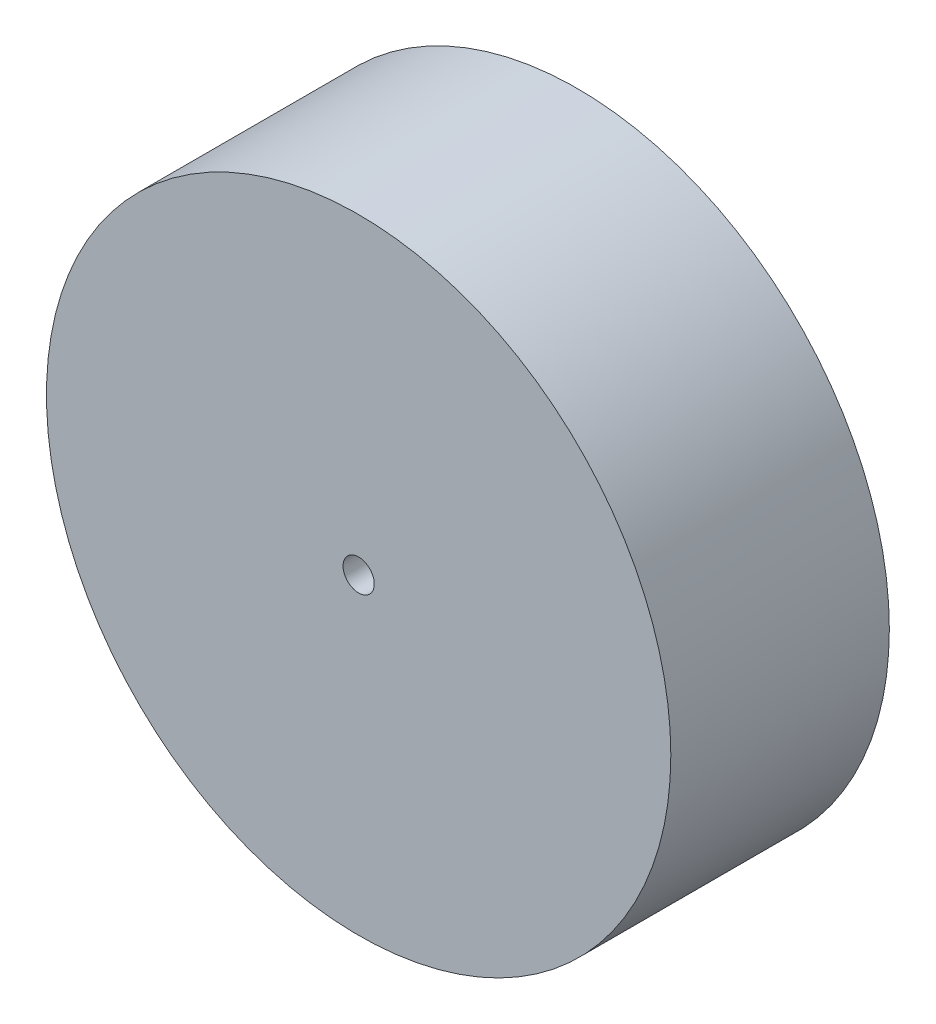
ISO-10303-21;
HEADER;
FILE_DESCRIPTION(('STEP AP214'),'2;1');
FILE_NAME('part.step','',(''),(''),'','','');
FILE_SCHEMA(('AUTOMOTIVE_DESIGN { 1 0 10303 214 1 1 1 1 }'));
ENDSEC;
DATA;
#1=APPLICATION_CONTEXT('core data for automotive mechanical design processes');
#2=APPLICATION_PROTOCOL_DEFINITION('international standard','automotive_design',2000,#1);
#3=PRODUCT_CONTEXT('',#1,'mechanical');
#4=PRODUCT('Part','Part','',(#3));
#5=PRODUCT_RELATED_PRODUCT_CATEGORY('part','',(#4));
#6=PRODUCT_DEFINITION_FORMATION('','',#4);
#7=PRODUCT_DEFINITION_CONTEXT('part definition',#1,'design');
#8=PRODUCT_DEFINITION('design','',#6,#7);
#9=PRODUCT_DEFINITION_SHAPE('','',#8);
#10=(LENGTH_UNIT() NAMED_UNIT(*) SI_UNIT(.MILLI.,.METRE.));
#11=(NAMED_UNIT(*) PLANE_ANGLE_UNIT() SI_UNIT($,.RADIAN.));
#12=(NAMED_UNIT(*) SI_UNIT($,.STERADIAN.) SOLID_ANGLE_UNIT());
#13=UNCERTAINTY_MEASURE_WITH_UNIT(LENGTH_MEASURE(1.E-05),#10,'distance_accuracy_value','');
#14=(GEOMETRIC_REPRESENTATION_CONTEXT(3) GLOBAL_UNCERTAINTY_ASSIGNED_CONTEXT((#13)) GLOBAL_UNIT_ASSIGNED_CONTEXT((#10,
#11,#12)) REPRESENTATION_CONTEXT('',''));
#15=CARTESIAN_POINT('',(0.,0.,0.));
#16=DIRECTION('',(0.,0.,1.));
#17=DIRECTION('',(1.,0.,0.));
#18=AXIS2_PLACEMENT_3D('',#15,#16,#17);
#19=CARTESIAN_POINT('',(0.,0.,30.));
#20=DIRECTION('',(0.,0.,-1.));
#21=DIRECTION('',(-1.,0.,0.));
#22=AXIS2_PLACEMENT_3D('',#19,#20,#21);
#23=CYLINDRICAL_SURFACE('',#22,10.);
#24=CARTESIAN_POINT('',(0.,0.,30.));
#25=DIRECTION('',(0.,0.,1.));
#26=DIRECTION('',(1.,0.,0.));
#27=AXIS2_PLACEMENT_3D('',#24,#25,#26);
#28=CIRCLE('',#27,10.);
#29=CARTESIAN_POINT('',(10.,0.,30.));
#30=VERTEX_POINT('',#29);
#31=EDGE_CURVE('E10',#30,#30,#28,.T.);
#32=ORIENTED_EDGE('',*,*,#31,.F.);
#33=EDGE_LOOP('',(#32));
#34=FACE_BOUND('',#33,.T.);
#35=CARTESIAN_POINT('',(0.,0.,0.));
#36=DIRECTION('',(0.,0.,1.));
#37=DIRECTION('',(1.,0.,0.));
#38=AXIS2_PLACEMENT_3D('',#35,#36,#37);
#39=CIRCLE('',#38,10.);
#40=CARTESIAN_POINT('',(10.,0.,0.));
#41=VERTEX_POINT('',#40);
#42=EDGE_CURVE('E39',#41,#41,#39,.T.);
#43=ORIENTED_EDGE('',*,*,#42,.T.);
#44=EDGE_LOOP('',(#43));
#45=FACE_BOUND('',#44,.T.);
#46=ADVANCED_FACE('F32',(#34,#45),#23,.T.);
#47=CARTESIAN_POINT('',(0.,0.,0.));
#48=DIRECTION('',(0.,0.,1.));
#49=DIRECTION('',(1.,0.,0.));
#50=AXIS2_PLACEMENT_3D('',#47,#48,#49);
#51=PLANE('',#50);
#52=CARTESIAN_POINT('',(0.,0.,0.));
#53=DIRECTION('',(0.,0.,-1.));
#54=DIRECTION('',(-1.,0.,0.));
#55=AXIS2_PLACEMENT_3D('',#52,#53,#54);
#56=CIRCLE('',#55,5.);
#57=CARTESIAN_POINT('',(-5.,0.,0.));
#58=VERTEX_POINT('',#57);
#59=EDGE_CURVE('E51',#58,#58,#56,.T.);
#60=ORIENTED_EDGE('',*,*,#59,.F.);
#61=EDGE_LOOP('',(#60));
#62=FACE_BOUND('',#61,.T.);
#63=ORIENTED_EDGE('',*,*,#42,.F.);
#64=EDGE_LOOP('',(#63));
#65=FACE_BOUND('',#64,.T.);
#66=ADVANCED_FACE('F70',(#62,#65),#51,.F.);
#67=CARTESIAN_POINT('',(0.,0.,100.));
#68=DIRECTION('',(0.,0.,-1.));
#69=DIRECTION('',(-1.,0.,0.));
#70=AXIS2_PLACEMENT_3D('',#67,#68,#69);
#71=CYLINDRICAL_SURFACE('',#70,100.);
#72=CARTESIAN_POINT('',(0.,0.,100.));
#73=DIRECTION('',(0.,0.,1.));
#74=DIRECTION('',(1.,0.,0.));
#75=AXIS2_PLACEMENT_3D('',#72,#73,#74);
#76=CIRCLE('',#75,100.);
#77=CARTESIAN_POINT('',(100.,0.,100.));
#78=VERTEX_POINT('',#77);
#79=EDGE_CURVE('E44',#78,#78,#76,.T.);
#80=ORIENTED_EDGE('',*,*,#79,.F.);
#81=EDGE_LOOP('',(#80));
#82=FACE_BOUND('',#81,.T.);
#83=CARTESIAN_POINT('',(0.,0.,30.));
#84=DIRECTION('',(0.,0.,1.));
#85=DIRECTION('',(1.,0.,0.));
#86=AXIS2_PLACEMENT_3D('',#83,#84,#85);
#87=CIRCLE('',#86,100.);
#88=CARTESIAN_POINT('',(100.,0.,30.));
#89=VERTEX_POINT('',#88);
#90=EDGE_CURVE('E46',#89,#89,#87,.T.);
#91=ORIENTED_EDGE('',*,*,#90,.T.);
#92=EDGE_LOOP('',(#91));
#93=FACE_BOUND('',#92,.T.);
#94=ADVANCED_FACE('F64',(#82,#93),#71,.T.);
#95=CARTESIAN_POINT('',(0.,0.,100.));
#96=DIRECTION('',(0.,0.,1.));
#97=DIRECTION('',(1.,0.,0.));
#98=AXIS2_PLACEMENT_3D('',#95,#96,#97);
#99=PLANE('',#98);
#100=CARTESIAN_POINT('',(0.,0.,100.));
#101=DIRECTION('',(0.,0.,1.));
#102=DIRECTION('',(1.,0.,0.));
#103=AXIS2_PLACEMENT_3D('',#100,#101,#102);
#104=CIRCLE('',#103,5.);
#105=CARTESIAN_POINT('',(5.,0.,100.));
#106=VERTEX_POINT('',#105);
#107=EDGE_CURVE('E35',#106,#106,#104,.T.);
#108=ORIENTED_EDGE('',*,*,#107,.F.);
#109=EDGE_LOOP('',(#108));
#110=FACE_BOUND('',#109,.T.);
#111=ORIENTED_EDGE('',*,*,#79,.T.);
#112=EDGE_LOOP('',(#111));
#113=FACE_BOUND('',#112,.T.);
#114=ADVANCED_FACE('F60',(#110,#113),#99,.T.);
#115=CARTESIAN_POINT('',(0.,0.,30.));
#116=DIRECTION('',(0.,0.,1.));
#117=DIRECTION('',(1.,0.,0.));
#118=AXIS2_PLACEMENT_3D('',#115,#116,#117);
#119=PLANE('',#118);
#120=ORIENTED_EDGE('',*,*,#31,.T.);
#121=EDGE_LOOP('',(#120));
#122=FACE_BOUND('',#121,.T.);
#123=ORIENTED_EDGE('',*,*,#90,.F.);
#124=EDGE_LOOP('',(#123));
#125=FACE_BOUND('',#124,.T.);
#126=ADVANCED_FACE('F63',(#122,#125),#119,.F.);
#127=CARTESIAN_POINT('',(0.,0.,110.));
#128=DIRECTION('',(0.,0.,-1.));
#129=DIRECTION('',(-1.,0.,0.));
#130=AXIS2_PLACEMENT_3D('',#127,#128,#129);
#131=CYLINDRICAL_SURFACE('',#130,5.);
#132=ORIENTED_EDGE('',*,*,#107,.T.);
#133=EDGE_LOOP('',(#132));
#134=FACE_BOUND('',#133,.T.);
#135=ORIENTED_EDGE('',*,*,#59,.T.);
#136=EDGE_LOOP('',(#135));
#137=FACE_BOUND('',#136,.T.);
#138=ADVANCED_FACE('F58',(#134,#137),#131,.F.);
#139=CLOSED_SHELL('',(#46,#66,#94,#114,#126,#138));
#140=MANIFOLD_SOLID_BREP('B2',#139);
#141=ADVANCED_BREP_SHAPE_REPRESENTATION('',(#18,#140),#14);
#142=SHAPE_DEFINITION_REPRESENTATION(#9,#141);
ENDSEC;
END-ISO-10303-21;
